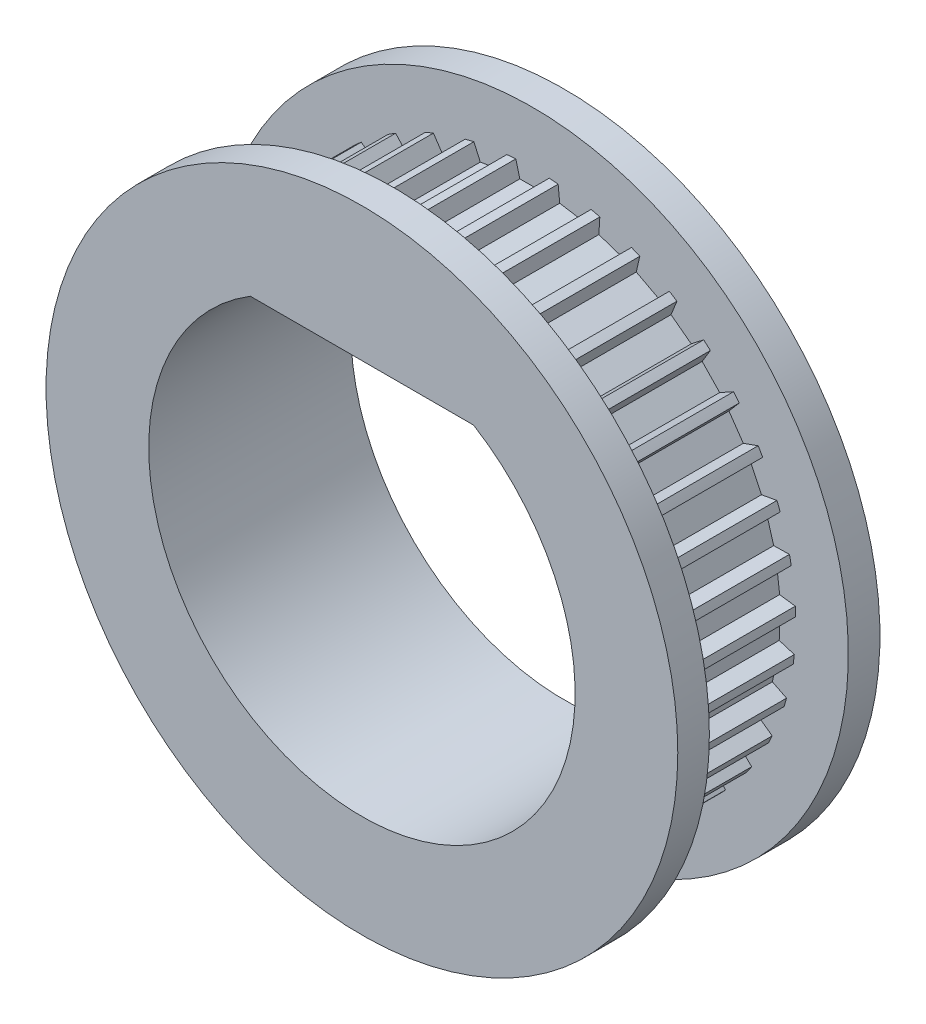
from build123d import *

# Parameters (mm, degrees)
SKETCH1_R               = 12.5
BOSS_EXTRUDE1_DEPTH     = 3.3
CUT_EXTRUDE1_START      = -6.6
CUT_EXTRUDE1_DEPTH      = 26.469552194
CIRPATTERN2_COUNT       = 39
SKETCH2_R               = 15
BOSS_EXTRUDE3_DEPTH     = 1.5
BOSS_EXTRUDE4_START     = 1.5
SKETCH3_R               = 14.999999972
BOSS_EXTRUDE4_DEPTH     = 1.5
CUT_EXTRUDE3_DEPTH      = 24.284329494
CUT_EXTRUDE3_DEPTH_BACK = 24.284329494


with BuildPart() as part:
    # Sketch1 → Boss-Extrude1 (new, symmetric)
    with BuildSketch(Plane.XY):
        Circle(SKETCH1_R)
    extrude(amount=BOSS_EXTRUDE1_DEPTH, both=True)

    # Sketch4 → Cut-Extrude1 (cut)
    with BuildSketch(Plane.XY.offset(3.3).offset(CUT_EXTRUDE1_START)):
        Polygon((-0.6, 11.75), (0.6, 11.75), (0.8, 12.5), (-0.8, 12.5), align=None)
    cut_extrude1 = extrude(amount=CUT_EXTRUDE1_DEPTH, mode=Mode.SUBTRACT)

    # CirPattern2: Cut-Extrude1 ×39 about axis
    cirpattern2_axis = Axis((0, 0, 0), (0, 0, 1))
    for i in range(1, CIRPATTERN2_COUNT):
        add(cut_extrude1.rotate(cirpattern2_axis, i * 360 / CIRPATTERN2_COUNT), mode=Mode.SUBTRACT)

    # Sketch2 → Boss-Extrude3 (add)
    with BuildSketch(Plane(origin=(0, 0, -3.3), x_dir=(-1, 0, 0), z_dir=(0, 0, -1))):
        Circle(SKETCH2_R)
    extrude(amount=BOSS_EXTRUDE3_DEPTH)

    # Sketch3 → Boss-Extrude4 (add)
    with BuildSketch(Plane.XY.offset(3.3).offset(BOSS_EXTRUDE4_START)):
        with Locations(Location((0, 0, 0), (0, 0, 180))):
            Circle(SKETCH3_R)
    extrude(amount=-BOSS_EXTRUDE4_DEPTH)

    # Sketch6 → Cut-Extrude3 (cut, two sides: drawn at the far end of the back side and taken through both)
    with BuildSketch(Plane.XY.offset(4.8).offset(-CUT_EXTRUDE3_DEPTH_BACK)):
        with BuildLine():
            Line((5.303300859, 8.625), (-5.303300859, 8.625))
            ThreePointArc((-5.303300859, 8.625), (-4.940632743, -8.83774706), (10.125, 0))
            ThreePointArc((10.125, 0), (8.83774706, 4.940632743), (5.303300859, 8.625))
        make_face()
    extrude(amount=CUT_EXTRUDE3_DEPTH + CUT_EXTRUDE3_DEPTH_BACK, mode=Mode.SUBTRACT)


solid = part.part
